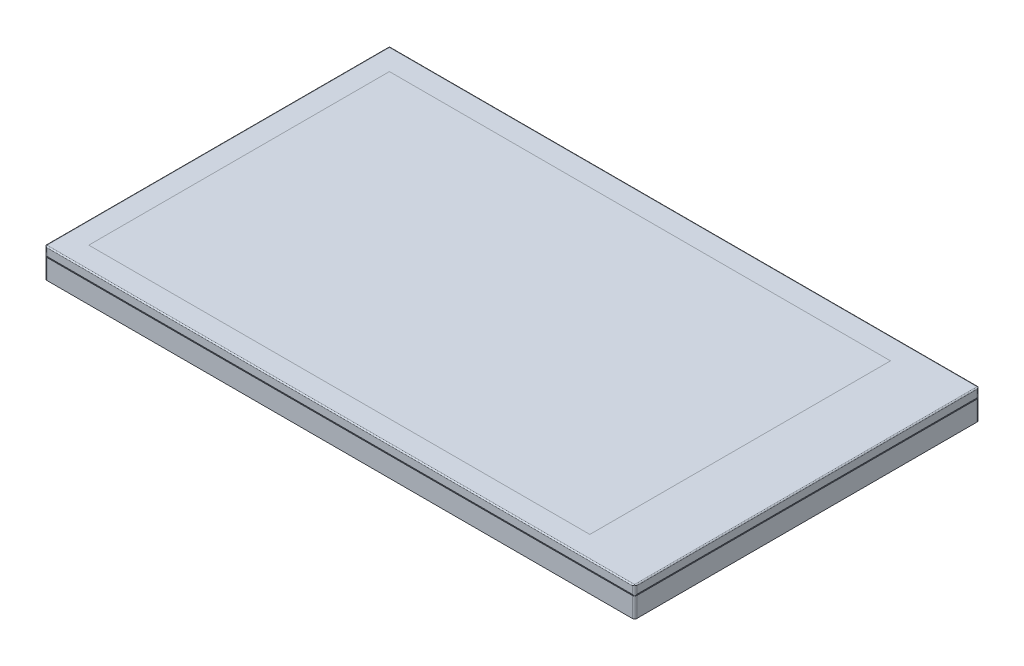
ISO-10303-21;
HEADER;
FILE_DESCRIPTION(('STEP AP214'),'2;1');
FILE_NAME('part.step','',(''),(''),'','','');
FILE_SCHEMA(('AUTOMOTIVE_DESIGN { 1 0 10303 214 1 1 1 1 }'));
ENDSEC;
DATA;
#1=APPLICATION_CONTEXT('core data for automotive mechanical design processes');
#2=APPLICATION_PROTOCOL_DEFINITION('international standard','automotive_design',2000,#1);
#3=PRODUCT_CONTEXT('',#1,'mechanical');
#4=PRODUCT('Part','Part','',(#3));
#5=PRODUCT_RELATED_PRODUCT_CATEGORY('part','',(#4));
#6=PRODUCT_DEFINITION_FORMATION('','',#4);
#7=PRODUCT_DEFINITION_CONTEXT('part definition',#1,'design');
#8=PRODUCT_DEFINITION('design','',#6,#7);
#9=PRODUCT_DEFINITION_SHAPE('','',#8);
#10=(LENGTH_UNIT() NAMED_UNIT(*) SI_UNIT(.MILLI.,.METRE.));
#11=(NAMED_UNIT(*) PLANE_ANGLE_UNIT() SI_UNIT($,.RADIAN.));
#12=(NAMED_UNIT(*) SI_UNIT($,.STERADIAN.) SOLID_ANGLE_UNIT());
#13=UNCERTAINTY_MEASURE_WITH_UNIT(LENGTH_MEASURE(1.E-05),#10,'distance_accuracy_value','');
#14=(GEOMETRIC_REPRESENTATION_CONTEXT(3) GLOBAL_UNCERTAINTY_ASSIGNED_CONTEXT((#13)) GLOBAL_UNIT_ASSIGNED_CONTEXT((#10,
#11,#12)) REPRESENTATION_CONTEXT('',''));
#15=CARTESIAN_POINT('',(0.,0.,0.));
#16=DIRECTION('',(0.,0.,1.));
#17=DIRECTION('',(1.,0.,0.));
#18=AXIS2_PLACEMENT_3D('',#15,#16,#17);
#19=CARTESIAN_POINT('',(0.,3.85,0.));
#20=DIRECTION('',(0.,-1.,0.));
#21=DIRECTION('',(0.,0.,-1.));
#22=AXIS2_PLACEMENT_3D('',#19,#20,#21);
#23=PLANE('',#22);
#24=DIRECTION('',(-1.,0.,0.));
#25=VECTOR('',#24,1.);
#26=CARTESIAN_POINT('',(61.5,3.85,-22.35));
#27=LINE('',#26,#25);
#28=CARTESIAN_POINT('',(38.35,3.85000000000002,-22.35));
#29=VERTEX_POINT('',#28);
#30=CARTESIAN_POINT('',(-38.35,3.85,-22.35));
#31=VERTEX_POINT('',#30);
#32=EDGE_CURVE('E234',#29,#31,#27,.T.);
#33=ORIENTED_EDGE('',*,*,#32,.T.);
#34=DIRECTION('',(0.,0.,1.));
#35=VECTOR('',#34,1.);
#36=CARTESIAN_POINT('',(-38.35,3.84999999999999,-50.));
#37=LINE('',#36,#35);
#38=CARTESIAN_POINT('',(-38.35,3.84999999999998,22.35));
#39=VERTEX_POINT('',#38);
#40=EDGE_CURVE('E300',#31,#39,#37,.T.);
#41=ORIENTED_EDGE('',*,*,#40,.T.);
#42=DIRECTION('',(-1.,0.,0.));
#43=VECTOR('',#42,1.);
#44=CARTESIAN_POINT('',(61.5,3.84999999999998,22.35));
#45=LINE('',#44,#43);
#46=CARTESIAN_POINT('',(38.35,3.85,22.35));
#47=VERTEX_POINT('',#46);
#48=EDGE_CURVE('E416',#47,#39,#45,.T.);
#49=ORIENTED_EDGE('',*,*,#48,.F.);
#50=DIRECTION('',(0.,0.,1.));
#51=VECTOR('',#50,1.);
#52=CARTESIAN_POINT('',(38.35,3.85,-50.));
#53=LINE('',#52,#51);
#54=EDGE_CURVE('E332',#29,#47,#53,.T.);
#55=ORIENTED_EDGE('',*,*,#54,.F.);
#56=EDGE_LOOP('',(#33,#41,#49,#55));
#57=FACE_BOUND('',#56,.T.);
#58=DIRECTION('',(0.,0.,1.));
#59=VECTOR('',#58,1.);
#60=CARTESIAN_POINT('',(-35.62,3.85,0.));
#61=LINE('',#60,#59);
#62=CARTESIAN_POINT('',(-35.62,3.85000000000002,-19.62));
#63=VERTEX_POINT('',#62);
#64=CARTESIAN_POINT('',(-35.62,3.85,19.62));
#65=VERTEX_POINT('',#64);
#66=EDGE_CURVE('E13',#63,#65,#61,.T.);
#67=ORIENTED_EDGE('',*,*,#66,.F.);
#68=DIRECTION('',(-1.,0.,0.));
#69=VECTOR('',#68,1.);
#70=CARTESIAN_POINT('',(0.,3.85,-19.62));
#71=LINE('',#70,#69);
#72=CARTESIAN_POINT('',(29.78,3.85000000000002,-19.62));
#73=VERTEX_POINT('',#72);
#74=EDGE_CURVE('E493',#73,#63,#71,.T.);
#75=ORIENTED_EDGE('',*,*,#74,.F.);
#76=DIRECTION('',(0.,0.,-1.));
#77=VECTOR('',#76,1.);
#78=CARTESIAN_POINT('',(29.78,3.85,0.));
#79=LINE('',#78,#77);
#80=CARTESIAN_POINT('',(29.78,3.85,19.62));
#81=VERTEX_POINT('',#80);
#82=EDGE_CURVE('E494',#81,#73,#79,.T.);
#83=ORIENTED_EDGE('',*,*,#82,.F.);
#84=DIRECTION('',(1.,0.,0.));
#85=VECTOR('',#84,1.);
#86=CARTESIAN_POINT('',(0.,3.85,19.62));
#87=LINE('',#86,#85);
#88=EDGE_CURVE('E63',#65,#81,#87,.T.);
#89=ORIENTED_EDGE('',*,*,#88,.F.);
#90=EDGE_LOOP('',(#67,#75,#83,#89));
#91=FACE_BOUND('',#90,.T.);
#92=ADVANCED_FACE('F53',(#57,#91),#23,.F.);
#93=ORIENTED_EDGE('',*,*,#74,.T.);
#94=ORIENTED_EDGE('',*,*,#66,.T.);
#95=ORIENTED_EDGE('',*,*,#88,.T.);
#96=ORIENTED_EDGE('',*,*,#82,.T.);
#97=EDGE_LOOP('',(#93,#94,#95,#96));
#98=FACE_BOUND('',#97,.T.);
#99=ADVANCED_FACE('F288',(#98),#23,.F.);
#100=CARTESIAN_POINT('',(-38.5,3.85,-22.5));
#101=DIRECTION('',(0.,0.,1.));
#102=DIRECTION('',(1.,0.,0.));
#103=AXIS2_PLACEMENT_3D('',#100,#101,#102);
#104=PLANE('',#103);
#105=DIRECTION('',(0.,-1.,0.));
#106=VECTOR('',#105,1.);
#107=CARTESIAN_POINT('',(-38.2,3.85,-22.5));
#108=LINE('',#107,#106);
#109=CARTESIAN_POINT('',(-38.2,2.75,-22.5));
#110=VERTEX_POINT('',#109);
#111=CARTESIAN_POINT('',(-38.2,3.7,-22.5));
#112=VERTEX_POINT('',#111);
#113=EDGE_CURVE('E243',#110,#112,#108,.F.);
#114=ORIENTED_EDGE('',*,*,#113,.T.);
#115=DIRECTION('',(-1.,0.,0.));
#116=VECTOR('',#115,1.);
#117=CARTESIAN_POINT('',(61.5,3.7,-22.5));
#118=LINE('',#117,#116);
#119=CARTESIAN_POINT('',(38.2,3.70000000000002,-22.5));
#120=VERTEX_POINT('',#119);
#121=EDGE_CURVE('E225',#120,#112,#118,.T.);
#122=ORIENTED_EDGE('',*,*,#121,.F.);
#123=DIRECTION('',(0.,-1.,0.));
#124=VECTOR('',#123,1.);
#125=CARTESIAN_POINT('',(38.2,3.85000000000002,-22.5));
#126=LINE('',#125,#124);
#127=CARTESIAN_POINT('',(38.2,2.75000000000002,-22.5));
#128=VERTEX_POINT('',#127);
#129=EDGE_CURVE('E240',#120,#128,#126,.T.);
#130=ORIENTED_EDGE('',*,*,#129,.T.);
#131=DIRECTION('',(-1.,0.,0.));
#132=VECTOR('',#131,1.);
#133=CARTESIAN_POINT('',(61.5,2.75,-22.5));
#134=LINE('',#133,#132);
#135=EDGE_CURVE('E550',#128,#110,#134,.T.);
#136=ORIENTED_EDGE('',*,*,#135,.T.);
#137=EDGE_LOOP('',(#114,#122,#130,#136));
#138=FACE_BOUND('',#137,.T.);
#139=ADVANCED_FACE('F238',(#138),#104,.F.);
#140=CARTESIAN_POINT('',(-38.2,3.85,-22.2));
#141=DIRECTION('',(0.,-1.,0.));
#142=DIRECTION('',(0.,0.,-1.));
#143=AXIS2_PLACEMENT_3D('',#140,#141,#142);
#144=CYLINDRICAL_SURFACE('',#143,0.3);
#145=CARTESIAN_POINT('',(-38.4598076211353,3.85,-22.35));
#146=CARTESIAN_POINT('',(-38.4533192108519,3.84998671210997,-22.3612714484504));
#147=CARTESIAN_POINT('',(-38.4461253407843,3.84873596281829,-22.3720101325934));
#148=CARTESIAN_POINT('',(-38.4307551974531,3.84433115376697,-22.3921121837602));
#149=CARTESIAN_POINT('',(-38.422593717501,3.84120337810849,-22.4014923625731));
#150=CARTESIAN_POINT('',(-38.4038947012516,3.83286018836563,-22.4205426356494));
#151=CARTESIAN_POINT('',(-38.3932007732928,3.82736050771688,-22.4299272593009));
#152=CARTESIAN_POINT('',(-38.3710569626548,3.81502326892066,-22.4468497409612));
#153=CARTESIAN_POINT('',(-38.3596028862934,3.80817779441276,-22.4543760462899));
#154=CARTESIAN_POINT('',(-38.3314887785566,3.79064939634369,-22.4703100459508));
#155=CARTESIAN_POINT('',(-38.3146005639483,3.77953575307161,-22.4778383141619));
#156=CARTESIAN_POINT('',(-38.2803840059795,3.75640250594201,-22.4895953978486));
#157=CARTESIAN_POINT('',(-38.2630562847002,3.7443841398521,-22.493828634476));
#158=CARTESIAN_POINT('',(-38.2314042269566,3.72220046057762,-22.4986980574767));
#159=CARTESIAN_POINT('',(-38.2171127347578,3.71210018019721,-22.4998520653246));
#160=CARTESIAN_POINT('',(-38.2018855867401,3.70133331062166,-22.4999955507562));
#161=CARTESIAN_POINT('',(-38.2009427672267,3.70066663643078,-22.4999999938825));
#162=CARTESIAN_POINT('',(-38.2,3.7,-22.5));
#163=B_SPLINE_CURVE_WITH_KNOTS('',3,(#145,#146,#147,#148,#149,#150,#151,#152,#153,#154,#155,
#156,#157,#158,#159,#160,#161,#162),.UNSPECIFIED.,.F.,.F.,(4,2,2,2,2,2,2,2,4),(0.,
0.0387726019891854,0.0770145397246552,0.122544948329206,0.168351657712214,0.232726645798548,
0.297015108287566,0.349497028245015,0.352961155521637),.UNSPECIFIED.);
#164=CARTESIAN_POINT('',(-38.4121320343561,3.83652695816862,-22.4121320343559));
#165=VERTEX_POINT('',#164);
#166=EDGE_CURVE('E553',#112,#165,#163,.F.);
#167=ORIENTED_EDGE('',*,*,#166,.F.);
#168=ORIENTED_EDGE('',*,*,#113,.F.);
#169=CARTESIAN_POINT('',(-38.4598076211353,2.6,-22.35));
#170=CARTESIAN_POINT('',(-38.4533192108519,2.60001328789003,-22.3612714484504));
#171=CARTESIAN_POINT('',(-38.4461253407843,2.60126403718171,-22.3720101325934));
#172=CARTESIAN_POINT('',(-38.4307551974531,2.60566884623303,-22.3921121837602));
#173=CARTESIAN_POINT('',(-38.422593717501,2.60879662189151,-22.4014923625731));
#174=CARTESIAN_POINT('',(-38.4038947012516,2.61713981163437,-22.4205426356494));
#175=CARTESIAN_POINT('',(-38.3932007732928,2.62263949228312,-22.4299272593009));
#176=CARTESIAN_POINT('',(-38.3710569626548,2.63497673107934,-22.4468497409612));
#177=CARTESIAN_POINT('',(-38.3596028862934,2.64182220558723,-22.4543760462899));
#178=CARTESIAN_POINT('',(-38.3314887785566,2.65935060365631,-22.4703100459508));
#179=CARTESIAN_POINT('',(-38.3146005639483,2.6704642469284,-22.4778383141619));
#180=CARTESIAN_POINT('',(-38.2803840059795,2.69359749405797,-22.4895953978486));
#181=CARTESIAN_POINT('',(-38.2630562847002,2.70561586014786,-22.493828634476));
#182=CARTESIAN_POINT('',(-38.2314042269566,2.7277995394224,-22.4986980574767));
#183=CARTESIAN_POINT('',(-38.2171127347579,2.7378998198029,-22.4998520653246));
#184=CARTESIAN_POINT('',(-38.2018855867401,2.74866668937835,-22.4999955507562));
#185=CARTESIAN_POINT('',(-38.2009427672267,2.74933336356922,-22.4999999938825));
#186=CARTESIAN_POINT('',(-38.2,2.75,-22.5));
#187=B_SPLINE_CURVE_WITH_KNOTS('',3,(#169,#170,#171,#172,#173,#174,#175,#176,#177,#178,#179,
#180,#181,#182,#183,#184,#185,#186),.UNSPECIFIED.,.F.,.F.,(4,2,2,2,2,2,2,2,4),(0.,
0.0387726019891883,0.0770145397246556,0.122544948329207,0.168351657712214,0.232726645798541,
0.297015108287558,0.349497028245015,0.352961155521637),.UNSPECIFIED.);
#188=CARTESIAN_POINT('',(-38.4121320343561,2.61347304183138,-22.4121320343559));
#189=VERTEX_POINT('',#188);
#190=EDGE_CURVE('E426',#189,#110,#187,.T.);
#191=ORIENTED_EDGE('',*,*,#190,.F.);
#192=CARTESIAN_POINT('',(-38.35,2.6,-22.4598076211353));
#193=CARTESIAN_POINT('',(-38.3612714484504,2.60001328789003,-22.4533192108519));
#194=CARTESIAN_POINT('',(-38.3720101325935,2.60126403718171,-22.4461253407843));
#195=CARTESIAN_POINT('',(-38.3921121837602,2.60566884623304,-22.4307551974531));
#196=CARTESIAN_POINT('',(-38.4014923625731,2.60879662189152,-22.422593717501));
#197=CARTESIAN_POINT('',(-38.4205426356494,2.61713981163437,-22.4038947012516));
#198=CARTESIAN_POINT('',(-38.4299272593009,2.62263949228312,-22.3932007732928));
#199=CARTESIAN_POINT('',(-38.4468497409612,2.63497673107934,-22.3710569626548));
#200=CARTESIAN_POINT('',(-38.4543760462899,2.64182220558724,-22.3596028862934));
#201=CARTESIAN_POINT('',(-38.4703100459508,2.65935060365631,-22.3314887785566));
#202=CARTESIAN_POINT('',(-38.4778383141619,2.6704642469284,-22.3146005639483));
#203=CARTESIAN_POINT('',(-38.4895953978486,2.69359749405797,-22.2803840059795));
#204=CARTESIAN_POINT('',(-38.493828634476,2.70561586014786,-22.2630562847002));
#205=CARTESIAN_POINT('',(-38.4986980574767,2.7277995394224,-22.2314042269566));
#206=CARTESIAN_POINT('',(-38.4998520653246,2.73789981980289,-22.2171127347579));
#207=CARTESIAN_POINT('',(-38.4999955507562,2.74866668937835,-22.2018855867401));
#208=CARTESIAN_POINT('',(-38.4999999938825,2.74933336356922,-22.2009427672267));
#209=CARTESIAN_POINT('',(-38.5,2.75,-22.2));
#210=B_SPLINE_CURVE_WITH_KNOTS('',3,(#192,#193,#194,#195,#196,#197,#198,#199,#200,#201,#202,
#203,#204,#205,#206,#207,#208,#209),.UNSPECIFIED.,.F.,.F.,(4,2,2,2,2,2,2,2,4),(0.,
0.0387726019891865,0.0770145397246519,0.122544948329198,0.168351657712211,0.232726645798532,
0.297015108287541,0.349497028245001,0.352961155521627),.UNSPECIFIED.);
#211=CARTESIAN_POINT('',(-38.5,2.75,-22.2));
#212=VERTEX_POINT('',#211);
#213=EDGE_CURVE('E272',#212,#189,#210,.F.);
#214=ORIENTED_EDGE('',*,*,#213,.F.);
#215=DIRECTION('',(0.,-1.,0.));
#216=VECTOR('',#215,1.);
#217=CARTESIAN_POINT('',(-38.5,3.85,-22.2));
#218=LINE('',#217,#216);
#219=CARTESIAN_POINT('',(-38.5,3.7,-22.2));
#220=VERTEX_POINT('',#219);
#221=EDGE_CURVE('E595',#220,#212,#218,.T.);
#222=ORIENTED_EDGE('',*,*,#221,.F.);
#223=CARTESIAN_POINT('',(-38.35,3.84999999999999,-22.4598076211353));
#224=CARTESIAN_POINT('',(-38.3612714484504,3.84998671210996,-22.4533192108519));
#225=CARTESIAN_POINT('',(-38.3720101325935,3.84873596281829,-22.4461253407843));
#226=CARTESIAN_POINT('',(-38.3921121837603,3.84433115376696,-22.4307551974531));
#227=CARTESIAN_POINT('',(-38.4014923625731,3.84120337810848,-22.422593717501));
#228=CARTESIAN_POINT('',(-38.4205426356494,3.83286018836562,-22.4038947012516));
#229=CARTESIAN_POINT('',(-38.4299272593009,3.82736050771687,-22.3932007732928));
#230=CARTESIAN_POINT('',(-38.4468497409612,3.81502326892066,-22.3710569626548));
#231=CARTESIAN_POINT('',(-38.4543760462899,3.80817779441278,-22.3596028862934));
#232=CARTESIAN_POINT('',(-38.4703100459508,3.79064939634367,-22.3314887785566));
#233=CARTESIAN_POINT('',(-38.4778383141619,3.77953575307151,-22.3146005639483));
#234=CARTESIAN_POINT('',(-38.4895953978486,3.75640250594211,-22.2803840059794));
#235=CARTESIAN_POINT('',(-38.493828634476,3.74438413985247,-22.2630562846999));
#236=CARTESIAN_POINT('',(-38.4986980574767,3.72220046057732,-22.2314042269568));
#237=CARTESIAN_POINT('',(-38.4998520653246,3.71210018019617,-22.2171127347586));
#238=CARTESIAN_POINT('',(-38.4999955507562,3.70133331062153,-22.2018855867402));
#239=CARTESIAN_POINT('',(-38.4999999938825,3.70066663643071,-22.2009427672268));
#240=CARTESIAN_POINT('',(-38.5,3.7,-22.2));
#241=B_SPLINE_CURVE_WITH_KNOTS('',3,(#223,#224,#225,#226,#227,#228,#229,#230,#231,#232,#233,
#234,#235,#236,#237,#238,#239,#240),.UNSPECIFIED.,.F.,.F.,(4,2,2,2,2,2,2,2,4),(0.,
0.0387726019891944,0.077014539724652,0.122544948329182,0.168351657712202,0.232726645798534,
0.297015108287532,0.349497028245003,0.352961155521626),.UNSPECIFIED.);
#242=EDGE_CURVE('E265',#165,#220,#241,.T.);
#243=ORIENTED_EDGE('',*,*,#242,.F.);
#244=EDGE_LOOP('',(#167,#168,#191,#214,#222,#243));
#245=FACE_BOUND('',#244,.T.);
#246=ADVANCED_FACE('F490',(#245),#144,.T.);
#247=CARTESIAN_POINT('',(38.2,3.85000000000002,-22.2));
#248=DIRECTION('',(0.,-1.,0.));
#249=DIRECTION('',(0.,0.,-1.));
#250=AXIS2_PLACEMENT_3D('',#247,#248,#249);
#251=CYLINDRICAL_SURFACE('',#250,0.3);
#252=CARTESIAN_POINT('',(38.4598076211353,3.85000000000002,-22.35));
#253=CARTESIAN_POINT('',(38.4533192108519,3.84998671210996,-22.3612714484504));
#254=CARTESIAN_POINT('',(38.4461253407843,3.84873596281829,-22.3720101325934));
#255=CARTESIAN_POINT('',(38.4307551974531,3.84433115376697,-22.3921121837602));
#256=CARTESIAN_POINT('',(38.4225937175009,3.8412033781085,-22.4014923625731));
#257=CARTESIAN_POINT('',(38.4038947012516,3.83286018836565,-22.4205426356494));
#258=CARTESIAN_POINT('',(38.3932007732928,3.82736050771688,-22.4299272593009));
#259=CARTESIAN_POINT('',(38.3710569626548,3.81502326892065,-22.4468497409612));
#260=CARTESIAN_POINT('',(38.3596028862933,3.80817779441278,-22.4543760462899));
#261=CARTESIAN_POINT('',(38.3314887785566,3.79064939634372,-22.4703100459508));
#262=CARTESIAN_POINT('',(38.3146005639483,3.77953575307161,-22.4778383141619));
#263=CARTESIAN_POINT('',(38.2803840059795,3.75640250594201,-22.4895953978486));
#264=CARTESIAN_POINT('',(38.2630562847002,3.74438413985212,-22.493828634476));
#265=CARTESIAN_POINT('',(38.2314042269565,3.72220046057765,-22.4986980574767));
#266=CARTESIAN_POINT('',(38.2171127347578,3.71210018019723,-22.4998520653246));
#267=CARTESIAN_POINT('',(38.2018855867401,3.70133331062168,-22.4999955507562));
#268=CARTESIAN_POINT('',(38.2009427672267,3.7006666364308,-22.4999999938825));
#269=CARTESIAN_POINT('',(38.2,3.70000000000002,-22.5));
#270=B_SPLINE_CURVE_WITH_KNOTS('',3,(#252,#253,#254,#255,#256,#257,#258,#259,#260,#261,#262,
#263,#264,#265,#266,#267,#268,#269),.UNSPECIFIED.,.F.,.F.,(4,2,2,2,2,2,2,2,4),(0.,
0.0387726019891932,0.0770145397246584,0.12254494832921,0.16835165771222,0.232726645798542,
0.297015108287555,0.349497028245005,0.352961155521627),.UNSPECIFIED.);
#271=CARTESIAN_POINT('',(38.412132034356,3.83652695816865,-22.4121320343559));
#272=VERTEX_POINT('',#271);
#273=EDGE_CURVE('E222',#272,#120,#270,.T.);
#274=ORIENTED_EDGE('',*,*,#273,.F.);
#275=CARTESIAN_POINT('',(38.35,3.85000000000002,-22.4598076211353));
#276=CARTESIAN_POINT('',(38.3612714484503,3.84998671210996,-22.4533192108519));
#277=CARTESIAN_POINT('',(38.3720101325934,3.84873596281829,-22.4461253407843));
#278=CARTESIAN_POINT('',(38.3921121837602,3.84433115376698,-22.4307551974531));
#279=CARTESIAN_POINT('',(38.401492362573,3.84120337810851,-22.422593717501));
#280=CARTESIAN_POINT('',(38.4205426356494,3.83286018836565,-22.4038947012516));
#281=CARTESIAN_POINT('',(38.4299272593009,3.82736050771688,-22.3932007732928));
#282=CARTESIAN_POINT('',(38.4468497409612,3.81502326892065,-22.3710569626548));
#283=CARTESIAN_POINT('',(38.4543760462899,3.80817779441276,-22.3596028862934));
#284=CARTESIAN_POINT('',(38.4703100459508,3.79064939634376,-22.3314887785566));
#285=CARTESIAN_POINT('',(38.4778383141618,3.77953575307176,-22.3146005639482));
#286=CARTESIAN_POINT('',(38.4895953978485,3.7564025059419,-22.2803840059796));
#287=CARTESIAN_POINT('',(38.493828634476,3.74438413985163,-22.2630562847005));
#288=CARTESIAN_POINT('',(38.4986980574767,3.72220046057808,-22.2314042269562));
#289=CARTESIAN_POINT('',(38.4998520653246,3.71210018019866,-22.2171127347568));
#290=CARTESIAN_POINT('',(38.4999955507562,3.70133331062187,-22.20188558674));
#291=CARTESIAN_POINT('',(38.4999999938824,3.7006666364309,-22.2009427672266));
#292=CARTESIAN_POINT('',(38.5,3.70000000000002,-22.2));
#293=B_SPLINE_CURVE_WITH_KNOTS('',3,(#275,#276,#277,#278,#279,#280,#281,#282,#283,#284,#285,
#286,#287,#288,#289,#290,#291,#292),.UNSPECIFIED.,.F.,.F.,(4,2,2,2,2,2,2,2,4),(0.,
0.0387726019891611,0.0770145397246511,0.122544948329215,0.168351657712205,0.232726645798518,
0.297015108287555,0.349497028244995,0.352961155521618),.UNSPECIFIED.);
#294=CARTESIAN_POINT('',(38.5,3.70000000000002,-22.2));
#295=VERTEX_POINT('',#294);
#296=EDGE_CURVE('E459',#295,#272,#293,.F.);
#297=ORIENTED_EDGE('',*,*,#296,.F.);
#298=DIRECTION('',(0.,-1.,0.));
#299=VECTOR('',#298,1.);
#300=CARTESIAN_POINT('',(38.5,3.85000000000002,-22.2));
#301=LINE('',#300,#299);
#302=CARTESIAN_POINT('',(38.5,2.75000000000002,-22.2));
#303=VERTEX_POINT('',#302);
#304=EDGE_CURVE('E258',#303,#295,#301,.F.);
#305=ORIENTED_EDGE('',*,*,#304,.F.);
#306=CARTESIAN_POINT('',(38.35,2.60000000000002,-22.4598076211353));
#307=CARTESIAN_POINT('',(38.3612714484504,2.60001328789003,-22.4533192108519));
#308=CARTESIAN_POINT('',(38.3720101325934,2.6012640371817,-22.4461253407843));
#309=CARTESIAN_POINT('',(38.3921121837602,2.60566884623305,-22.4307551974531));
#310=CARTESIAN_POINT('',(38.4014923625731,2.60879662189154,-22.4225937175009));
#311=CARTESIAN_POINT('',(38.4205426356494,2.6171398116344,-22.4038947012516));
#312=CARTESIAN_POINT('',(38.4299272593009,2.62263949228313,-22.3932007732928));
#313=CARTESIAN_POINT('',(38.4468497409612,2.63497673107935,-22.3710569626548));
#314=CARTESIAN_POINT('',(38.4543760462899,2.64182220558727,-22.3596028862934));
#315=CARTESIAN_POINT('',(38.4703100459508,2.65935060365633,-22.3314887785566));
#316=CARTESIAN_POINT('',(38.4778383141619,2.67046424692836,-22.3146005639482));
#317=CARTESIAN_POINT('',(38.4895953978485,2.69359749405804,-22.2803840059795));
#318=CARTESIAN_POINT('',(38.493828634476,2.70561586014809,-22.2630562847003));
#319=CARTESIAN_POINT('',(38.4986980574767,2.72779953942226,-22.2314042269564));
#320=CARTESIAN_POINT('',(38.4998520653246,2.73789981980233,-22.2171127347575));
#321=CARTESIAN_POINT('',(38.4999955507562,2.7486666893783,-22.2018855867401));
#322=CARTESIAN_POINT('',(38.4999999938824,2.7493333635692,-22.2009427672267));
#323=CARTESIAN_POINT('',(38.5,2.75000000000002,-22.2));
#324=B_SPLINE_CURVE_WITH_KNOTS('',3,(#306,#307,#308,#309,#310,#311,#312,#313,#314,#315,#316,
#317,#318,#319,#320,#321,#322,#323),.UNSPECIFIED.,.F.,.F.,(4,2,2,2,2,2,2,2,4),(0.,
0.0387726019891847,0.0770145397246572,0.122544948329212,0.168351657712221,0.232726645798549,
0.297015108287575,0.349497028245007,0.352961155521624),.UNSPECIFIED.);
#325=CARTESIAN_POINT('',(38.412132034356,2.6134730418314,-22.4121320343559));
#326=VERTEX_POINT('',#325);
#327=EDGE_CURVE('E453',#326,#303,#324,.T.);
#328=ORIENTED_EDGE('',*,*,#327,.F.);
#329=CARTESIAN_POINT('',(38.4598076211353,2.60000000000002,-22.35));
#330=CARTESIAN_POINT('',(38.4533192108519,2.60001328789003,-22.3612714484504));
#331=CARTESIAN_POINT('',(38.4461253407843,2.6012640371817,-22.3720101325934));
#332=CARTESIAN_POINT('',(38.4307551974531,2.60566884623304,-22.3921121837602));
#333=CARTESIAN_POINT('',(38.4225937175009,2.60879662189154,-22.4014923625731));
#334=CARTESIAN_POINT('',(38.4038947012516,2.6171398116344,-22.4205426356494));
#335=CARTESIAN_POINT('',(38.3932007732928,2.62263949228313,-22.4299272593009));
#336=CARTESIAN_POINT('',(38.3710569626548,2.63497673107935,-22.4468497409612));
#337=CARTESIAN_POINT('',(38.3596028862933,2.64182220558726,-22.4543760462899));
#338=CARTESIAN_POINT('',(38.3314887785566,2.65935060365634,-22.4703100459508));
#339=CARTESIAN_POINT('',(38.3146005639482,2.67046424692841,-22.4778383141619));
#340=CARTESIAN_POINT('',(38.2803840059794,2.69359749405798,-22.4895953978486));
#341=CARTESIAN_POINT('',(38.2630562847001,2.70561586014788,-22.493828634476));
#342=CARTESIAN_POINT('',(38.2314042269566,2.72779953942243,-22.4986980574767));
#343=CARTESIAN_POINT('',(38.2171127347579,2.73789981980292,-22.4998520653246));
#344=CARTESIAN_POINT('',(38.2018855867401,2.74866668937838,-22.4999955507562));
#345=CARTESIAN_POINT('',(38.2009427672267,2.74933336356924,-22.4999999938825));
#346=CARTESIAN_POINT('',(38.2,2.75000000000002,-22.5));
#347=B_SPLINE_CURVE_WITH_KNOTS('',3,(#329,#330,#331,#332,#333,#334,#335,#336,#337,#338,#339,
#340,#341,#342,#343,#344,#345,#346),.UNSPECIFIED.,.F.,.F.,(4,2,2,2,2,2,2,2,4),(0.,
0.0387726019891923,0.0770145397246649,0.12254494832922,0.16835165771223,0.232726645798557,
0.297015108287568,0.349497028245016,0.352961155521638),.UNSPECIFIED.);
#348=EDGE_CURVE('E248',#128,#326,#347,.F.);
#349=ORIENTED_EDGE('',*,*,#348,.F.);
#350=ORIENTED_EDGE('',*,*,#129,.F.);
#351=EDGE_LOOP('',(#274,#297,#305,#328,#349,#350));
#352=FACE_BOUND('',#351,.T.);
#353=ADVANCED_FACE('F246',(#352),#251,.T.);
#354=CARTESIAN_POINT('',(-38.5,3.84999999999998,22.5));
#355=DIRECTION('',(0.,0.,-1.));
#356=DIRECTION('',(-1.,0.,0.));
#357=AXIS2_PLACEMENT_3D('',#354,#355,#356);
#358=PLANE('',#357);
#359=DIRECTION('',(-1.,0.,0.));
#360=VECTOR('',#359,1.);
#361=CARTESIAN_POINT('',(61.5,3.69999999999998,22.5));
#362=LINE('',#361,#360);
#363=CARTESIAN_POINT('',(38.2,3.7,22.5));
#364=VERTEX_POINT('',#363);
#365=CARTESIAN_POINT('',(-38.2,3.69999999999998,22.5));
#366=VERTEX_POINT('',#365);
#367=EDGE_CURVE('E425',#364,#366,#362,.T.);
#368=ORIENTED_EDGE('',*,*,#367,.T.);
#369=DIRECTION('',(0.,-1.,0.));
#370=VECTOR('',#369,1.);
#371=CARTESIAN_POINT('',(-38.2,3.84999999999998,22.5));
#372=LINE('',#371,#370);
#373=CARTESIAN_POINT('',(-38.2,2.74999999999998,22.5));
#374=VERTEX_POINT('',#373);
#375=EDGE_CURVE('E578',#366,#374,#372,.T.);
#376=ORIENTED_EDGE('',*,*,#375,.T.);
#377=DIRECTION('',(-1.,0.,0.));
#378=VECTOR('',#377,1.);
#379=CARTESIAN_POINT('',(61.5,2.74999999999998,22.5));
#380=LINE('',#379,#378);
#381=CARTESIAN_POINT('',(38.2,2.75,22.5));
#382=VERTEX_POINT('',#381);
#383=EDGE_CURVE('E440',#382,#374,#380,.T.);
#384=ORIENTED_EDGE('',*,*,#383,.F.);
#385=DIRECTION('',(0.,-1.,0.));
#386=VECTOR('',#385,1.);
#387=CARTESIAN_POINT('',(38.2,3.85,22.5));
#388=LINE('',#387,#386);
#389=EDGE_CURVE('E579',#382,#364,#388,.F.);
#390=ORIENTED_EDGE('',*,*,#389,.T.);
#391=EDGE_LOOP('',(#368,#376,#384,#390));
#392=FACE_BOUND('',#391,.T.);
#393=ADVANCED_FACE('F576',(#392),#358,.F.);
#394=CARTESIAN_POINT('',(-38.2,3.84999999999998,22.2));
#395=DIRECTION('',(0.,-1.,0.));
#396=DIRECTION('',(0.,0.,-1.));
#397=AXIS2_PLACEMENT_3D('',#394,#395,#396);
#398=CYLINDRICAL_SURFACE('',#397,0.3);
#399=CARTESIAN_POINT('',(-38.4598076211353,3.84999999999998,22.35));
#400=CARTESIAN_POINT('',(-38.4533192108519,3.84998671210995,22.3612714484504));
#401=CARTESIAN_POINT('',(-38.4461253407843,3.84873596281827,22.3720101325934));
#402=CARTESIAN_POINT('',(-38.4307551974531,3.84433115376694,22.3921121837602));
#403=CARTESIAN_POINT('',(-38.422593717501,3.84120337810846,22.4014923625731));
#404=CARTESIAN_POINT('',(-38.4038947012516,3.83286018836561,22.4205426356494));
#405=CARTESIAN_POINT('',(-38.3932007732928,3.82736050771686,22.4299272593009));
#406=CARTESIAN_POINT('',(-38.3710569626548,3.81502326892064,22.4468497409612));
#407=CARTESIAN_POINT('',(-38.3596028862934,3.80817779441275,22.4543760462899));
#408=CARTESIAN_POINT('',(-38.3314887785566,3.79064939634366,22.4703100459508));
#409=CARTESIAN_POINT('',(-38.3146005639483,3.77953575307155,22.4778383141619));
#410=CARTESIAN_POINT('',(-38.2803840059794,3.75640250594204,22.4895953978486));
#411=CARTESIAN_POINT('',(-38.2630562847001,3.74438413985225,22.493828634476));
#412=CARTESIAN_POINT('',(-38.2314042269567,3.72220046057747,22.4986980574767));
#413=CARTESIAN_POINT('',(-38.2171127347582,3.71210018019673,22.4998520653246));
#414=CARTESIAN_POINT('',(-38.2018855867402,3.70133331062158,22.4999955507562));
#415=CARTESIAN_POINT('',(-38.2009427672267,3.70066663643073,22.4999999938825));
#416=CARTESIAN_POINT('',(-38.2,3.69999999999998,22.5));
#417=B_SPLINE_CURVE_WITH_KNOTS('',3,(#399,#400,#401,#402,#403,#404,#405,#406,#407,#408,#409,
#410,#411,#412,#413,#414,#415,#416),.UNSPECIFIED.,.F.,.F.,(4,2,2,2,2,2,2,2,4),(0.,
0.0387726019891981,0.0770145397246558,0.122544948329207,0.168351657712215,0.232726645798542,
0.297015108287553,0.349497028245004,0.352961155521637),.UNSPECIFIED.);
#418=CARTESIAN_POINT('',(-38.4121320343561,3.8365269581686,22.4121320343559));
#419=VERTEX_POINT('',#418);
#420=EDGE_CURVE('E429',#419,#366,#417,.T.);
#421=ORIENTED_EDGE('',*,*,#420,.F.);
#422=CARTESIAN_POINT('',(-38.35,3.84999999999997,22.4598076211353));
#423=CARTESIAN_POINT('',(-38.3612714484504,3.84998671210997,22.4533192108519));
#424=CARTESIAN_POINT('',(-38.3720101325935,3.84873596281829,22.4461253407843));
#425=CARTESIAN_POINT('',(-38.3921121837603,3.84433115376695,22.4307551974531));
#426=CARTESIAN_POINT('',(-38.4014923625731,3.84120337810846,22.4225937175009));
#427=CARTESIAN_POINT('',(-38.4205426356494,3.8328601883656,22.4038947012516));
#428=CARTESIAN_POINT('',(-38.4299272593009,3.82736050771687,22.3932007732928));
#429=CARTESIAN_POINT('',(-38.4468497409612,3.81502326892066,22.3710569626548));
#430=CARTESIAN_POINT('',(-38.4543760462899,3.80817779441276,22.3596028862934));
#431=CARTESIAN_POINT('',(-38.4703100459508,3.79064939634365,22.3314887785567));
#432=CARTESIAN_POINT('',(-38.4778383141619,3.7795357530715,22.3146005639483));
#433=CARTESIAN_POINT('',(-38.4895953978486,3.7564025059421,22.2803840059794));
#434=CARTESIAN_POINT('',(-38.493828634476,3.74438413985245,22.2630562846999));
#435=CARTESIAN_POINT('',(-38.4986980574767,3.7222004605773,22.2314042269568));
#436=CARTESIAN_POINT('',(-38.4998520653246,3.71210018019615,22.2171127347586));
#437=CARTESIAN_POINT('',(-38.4999955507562,3.7013333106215,22.2018855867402));
#438=CARTESIAN_POINT('',(-38.4999999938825,3.70066663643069,22.2009427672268));
#439=CARTESIAN_POINT('',(-38.5,3.69999999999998,22.2));
#440=B_SPLINE_CURVE_WITH_KNOTS('',3,(#422,#423,#424,#425,#426,#427,#428,#429,#430,#431,#432,
#433,#434,#435,#436,#437,#438,#439),.UNSPECIFIED.,.F.,.F.,(4,2,2,2,2,2,2,2,4),(0.,
0.0387726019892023,0.0770145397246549,0.122544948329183,0.168351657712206,0.232726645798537,
0.297015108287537,0.349497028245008,0.352961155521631),.UNSPECIFIED.);
#441=CARTESIAN_POINT('',(-38.5,3.69999999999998,22.2));
#442=VERTEX_POINT('',#441);
#443=EDGE_CURVE('E292',#442,#419,#440,.F.);
#444=ORIENTED_EDGE('',*,*,#443,.F.);
#445=DIRECTION('',(0.,-1.,0.));
#446=VECTOR('',#445,1.);
#447=CARTESIAN_POINT('',(-38.5,3.84999999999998,22.2));
#448=LINE('',#447,#446);
#449=CARTESIAN_POINT('',(-38.5,2.74999999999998,22.2));
#450=VERTEX_POINT('',#449);
#451=EDGE_CURVE('E597',#450,#442,#448,.F.);
#452=ORIENTED_EDGE('',*,*,#451,.F.);
#453=CARTESIAN_POINT('',(-38.35,2.59999999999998,22.4598076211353));
#454=CARTESIAN_POINT('',(-38.3612714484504,2.60001328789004,22.4533192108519));
#455=CARTESIAN_POINT('',(-38.3720101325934,2.60126403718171,22.4461253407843));
#456=CARTESIAN_POINT('',(-38.3921121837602,2.60566884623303,22.4307551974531));
#457=CARTESIAN_POINT('',(-38.4014923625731,2.6087966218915,22.422593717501));
#458=CARTESIAN_POINT('',(-38.4205426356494,2.61713981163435,22.4038947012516));
#459=CARTESIAN_POINT('',(-38.4299272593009,2.62263949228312,22.3932007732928));
#460=CARTESIAN_POINT('',(-38.4468497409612,2.63497673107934,22.3710569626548));
#461=CARTESIAN_POINT('',(-38.4543760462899,2.64182220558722,22.3596028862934));
#462=CARTESIAN_POINT('',(-38.4703100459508,2.65935060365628,22.3314887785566));
#463=CARTESIAN_POINT('',(-38.4778383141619,2.67046424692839,22.3146005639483));
#464=CARTESIAN_POINT('',(-38.4895953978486,2.69359749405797,22.2803840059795));
#465=CARTESIAN_POINT('',(-38.493828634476,2.70561586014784,22.2630562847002));
#466=CARTESIAN_POINT('',(-38.4986980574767,2.72779953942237,22.2314042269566));
#467=CARTESIAN_POINT('',(-38.4998520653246,2.73789981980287,22.2171127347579));
#468=CARTESIAN_POINT('',(-38.4999955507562,2.74866668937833,22.2018855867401));
#469=CARTESIAN_POINT('',(-38.4999999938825,2.7493333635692,22.2009427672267));
#470=CARTESIAN_POINT('',(-38.5,2.74999999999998,22.2));
#471=B_SPLINE_CURVE_WITH_KNOTS('',3,(#453,#454,#455,#456,#457,#458,#459,#460,#461,#462,#463,
#464,#465,#466,#467,#468,#469,#470),.UNSPECIFIED.,.F.,.F.,(4,2,2,2,2,2,2,2,4),(0.,
0.0387726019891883,0.0770145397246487,0.122544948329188,0.168351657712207,0.232726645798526,
0.297015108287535,0.349497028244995,0.352961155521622),.UNSPECIFIED.);
#472=CARTESIAN_POINT('',(-38.4121320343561,2.61347304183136,22.4121320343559));
#473=VERTEX_POINT('',#472);
#474=EDGE_CURVE('E318',#473,#450,#471,.T.);
#475=ORIENTED_EDGE('',*,*,#474,.F.);
#476=CARTESIAN_POINT('',(-38.4598076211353,2.59999999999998,22.35));
#477=CARTESIAN_POINT('',(-38.4533192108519,2.60001328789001,22.3612714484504));
#478=CARTESIAN_POINT('',(-38.4461253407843,2.60126403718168,22.3720101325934));
#479=CARTESIAN_POINT('',(-38.4307551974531,2.60566884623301,22.3921121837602));
#480=CARTESIAN_POINT('',(-38.422593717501,2.60879662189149,22.4014923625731));
#481=CARTESIAN_POINT('',(-38.4038947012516,2.61713981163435,22.4205426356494));
#482=CARTESIAN_POINT('',(-38.3932007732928,2.6226394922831,22.4299272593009));
#483=CARTESIAN_POINT('',(-38.3710569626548,2.63497673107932,22.4468497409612));
#484=CARTESIAN_POINT('',(-38.3596028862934,2.64182220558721,22.4543760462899));
#485=CARTESIAN_POINT('',(-38.3314887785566,2.6593506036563,22.4703100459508));
#486=CARTESIAN_POINT('',(-38.3146005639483,2.67046424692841,22.4778383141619));
#487=CARTESIAN_POINT('',(-38.2803840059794,2.69359749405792,22.4895953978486));
#488=CARTESIAN_POINT('',(-38.2630562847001,2.70561586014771,22.493828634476));
#489=CARTESIAN_POINT('',(-38.2314042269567,2.72779953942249,22.4986980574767));
#490=CARTESIAN_POINT('',(-38.2171127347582,2.73789981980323,22.4998520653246));
#491=CARTESIAN_POINT('',(-38.2018855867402,2.74866668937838,22.4999955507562));
#492=CARTESIAN_POINT('',(-38.2009427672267,2.74933336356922,22.4999999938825));
#493=CARTESIAN_POINT('',(-38.2,2.74999999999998,22.5));
#494=B_SPLINE_CURVE_WITH_KNOTS('',3,(#476,#477,#478,#479,#480,#481,#482,#483,#484,#485,#486,
#487,#488,#489,#490,#491,#492,#493),.UNSPECIFIED.,.F.,.F.,(4,2,2,2,2,2,2,2,4),(0.,
0.0387726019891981,0.0770145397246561,0.122544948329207,0.168351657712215,0.232726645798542,
0.297015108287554,0.349497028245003,0.352961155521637),.UNSPECIFIED.);
#495=EDGE_CURVE('E325',#374,#473,#494,.F.);
#496=ORIENTED_EDGE('',*,*,#495,.F.);
#497=ORIENTED_EDGE('',*,*,#375,.F.);
#498=EDGE_LOOP('',(#421,#444,#452,#475,#496,#497));
#499=FACE_BOUND('',#498,.T.);
#500=ADVANCED_FACE('F310',(#499),#398,.T.);
#501=CARTESIAN_POINT('',(38.2,3.85,22.2));
#502=DIRECTION('',(0.,-1.,0.));
#503=DIRECTION('',(0.,0.,-1.));
#504=AXIS2_PLACEMENT_3D('',#501,#502,#503);
#505=CYLINDRICAL_SURFACE('',#504,0.3);
#506=CARTESIAN_POINT('',(38.4598076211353,3.85,22.35));
#507=CARTESIAN_POINT('',(38.4533192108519,3.84998671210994,22.3612714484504));
#508=CARTESIAN_POINT('',(38.4461253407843,3.84873596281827,22.3720101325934));
#509=CARTESIAN_POINT('',(38.4307551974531,3.84433115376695,22.3921121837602));
#510=CARTESIAN_POINT('',(38.4225937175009,3.84120337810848,22.4014923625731));
#511=CARTESIAN_POINT('',(38.4038947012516,3.83286018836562,22.4205426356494));
#512=CARTESIAN_POINT('',(38.3932007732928,3.82736050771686,22.4299272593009));
#513=CARTESIAN_POINT('',(38.3710569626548,3.81502326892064,22.4468497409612));
#514=CARTESIAN_POINT('',(38.3596028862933,3.80817779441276,22.4543760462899));
#515=CARTESIAN_POINT('',(38.3314887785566,3.79064939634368,22.4703100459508));
#516=CARTESIAN_POINT('',(38.3146005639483,3.77953575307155,22.4778383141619));
#517=CARTESIAN_POINT('',(38.2803840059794,3.75640250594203,22.4895953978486));
#518=CARTESIAN_POINT('',(38.2630562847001,3.74438413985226,22.493828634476));
#519=CARTESIAN_POINT('',(38.2314042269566,3.72220046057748,22.4986980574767));
#520=CARTESIAN_POINT('',(38.2171127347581,3.71210018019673,22.4998520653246));
#521=CARTESIAN_POINT('',(38.2018855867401,3.7013333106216,22.4999955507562));
#522=CARTESIAN_POINT('',(38.2009427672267,3.70066663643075,22.4999999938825));
#523=CARTESIAN_POINT('',(38.2,3.7,22.5));
#524=B_SPLINE_CURVE_WITH_KNOTS('',3,(#506,#507,#508,#509,#510,#511,#512,#513,#514,#515,#516,
#517,#518,#519,#520,#521,#522,#523),.UNSPECIFIED.,.F.,.F.,(4,2,2,2,2,2,2,2,4),(0.,
0.0387726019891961,0.077014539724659,0.122544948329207,0.16835165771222,0.232726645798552,
0.29701510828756,0.349497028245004,0.352961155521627),.UNSPECIFIED.);
#525=CARTESIAN_POINT('',(38.4121320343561,3.83652695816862,22.4121320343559));
#526=VERTEX_POINT('',#525);
#527=EDGE_CURVE('E430',#364,#526,#524,.F.);
#528=ORIENTED_EDGE('',*,*,#527,.F.);
#529=ORIENTED_EDGE('',*,*,#389,.F.);
#530=CARTESIAN_POINT('',(38.4598076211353,2.6,22.35));
#531=CARTESIAN_POINT('',(38.4533192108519,2.60001328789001,22.3612714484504));
#532=CARTESIAN_POINT('',(38.4461253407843,2.60126403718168,22.3720101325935));
#533=CARTESIAN_POINT('',(38.4307551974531,2.60566884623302,22.3921121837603));
#534=CARTESIAN_POINT('',(38.4225937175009,2.60879662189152,22.4014923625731));
#535=CARTESIAN_POINT('',(38.4038947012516,2.61713981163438,22.4205426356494));
#536=CARTESIAN_POINT('',(38.3932007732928,2.62263949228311,22.4299272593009));
#537=CARTESIAN_POINT('',(38.3710569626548,2.63497673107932,22.4468497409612));
#538=CARTESIAN_POINT('',(38.3596028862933,2.64182220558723,22.4543760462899));
#539=CARTESIAN_POINT('',(38.3314887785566,2.65935060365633,22.4703100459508));
#540=CARTESIAN_POINT('',(38.3146005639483,2.67046424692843,22.4778383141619));
#541=CARTESIAN_POINT('',(38.2803840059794,2.69359749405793,22.4895953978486));
#542=CARTESIAN_POINT('',(38.2630562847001,2.70561586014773,22.493828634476));
#543=CARTESIAN_POINT('',(38.2314042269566,2.72779953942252,22.4986980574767));
#544=CARTESIAN_POINT('',(38.2171127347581,2.73789981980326,22.4998520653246));
#545=CARTESIAN_POINT('',(38.2018855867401,2.7486666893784,22.4999955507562));
#546=CARTESIAN_POINT('',(38.2009427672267,2.74933336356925,22.4999999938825));
#547=CARTESIAN_POINT('',(38.2,2.75,22.5));
#548=B_SPLINE_CURVE_WITH_KNOTS('',3,(#530,#531,#532,#533,#534,#535,#536,#537,#538,#539,#540,
#541,#542,#543,#544,#545,#546,#547),.UNSPECIFIED.,.F.,.F.,(4,2,2,2,2,2,2,2,4),(0.,
0.0387726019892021,0.0770145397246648,0.122544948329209,0.168351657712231,0.232726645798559,
0.297015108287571,0.349497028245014,0.352961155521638),.UNSPECIFIED.);
#549=CARTESIAN_POINT('',(38.4121320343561,2.61347304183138,22.4121320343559));
#550=VERTEX_POINT('',#549);
#551=EDGE_CURVE('E350',#550,#382,#548,.T.);
#552=ORIENTED_EDGE('',*,*,#551,.F.);
#553=CARTESIAN_POINT('',(38.35,2.6,22.4598076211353));
#554=CARTESIAN_POINT('',(38.3612714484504,2.60001328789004,22.4533192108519));
#555=CARTESIAN_POINT('',(38.3720101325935,2.60126403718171,22.4461253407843));
#556=CARTESIAN_POINT('',(38.3921121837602,2.60566884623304,22.4307551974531));
#557=CARTESIAN_POINT('',(38.4014923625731,2.60879662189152,22.4225937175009));
#558=CARTESIAN_POINT('',(38.4205426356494,2.61713981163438,22.4038947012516));
#559=CARTESIAN_POINT('',(38.4299272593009,2.62263949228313,22.3932007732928));
#560=CARTESIAN_POINT('',(38.4468497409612,2.63497673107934,22.3710569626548));
#561=CARTESIAN_POINT('',(38.4543760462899,2.64182220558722,22.3596028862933));
#562=CARTESIAN_POINT('',(38.4703100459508,2.65935060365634,22.3314887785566));
#563=CARTESIAN_POINT('',(38.4778383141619,2.67046424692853,22.3146005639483));
#564=CARTESIAN_POINT('',(38.4895953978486,2.69359749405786,22.2803840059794));
#565=CARTESIAN_POINT('',(38.493828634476,2.70561586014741,22.2630562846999));
#566=CARTESIAN_POINT('',(38.4986980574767,2.72779953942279,22.2314042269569));
#567=CARTESIAN_POINT('',(38.4998520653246,2.7378998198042,22.2171127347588));
#568=CARTESIAN_POINT('',(38.4999955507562,2.74866668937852,22.2018855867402));
#569=CARTESIAN_POINT('',(38.4999999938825,2.74933336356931,22.2009427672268));
#570=CARTESIAN_POINT('',(38.5,2.75,22.2));
#571=B_SPLINE_CURVE_WITH_KNOTS('',3,(#553,#554,#555,#556,#557,#558,#559,#560,#561,#562,#563,
#564,#565,#566,#567,#568,#569,#570),.UNSPECIFIED.,.F.,.F.,(4,2,2,2,2,2,2,2,4),(0.,
0.0387726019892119,0.077014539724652,0.122544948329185,0.168351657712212,0.232726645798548,
0.297015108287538,0.349497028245,0.352961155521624),.UNSPECIFIED.);
#572=CARTESIAN_POINT('',(38.5,2.75,22.2));
#573=VERTEX_POINT('',#572);
#574=EDGE_CURVE('E365',#573,#550,#571,.F.);
#575=ORIENTED_EDGE('',*,*,#574,.F.);
#576=DIRECTION('',(0.,-1.,0.));
#577=VECTOR('',#576,1.);
#578=CARTESIAN_POINT('',(38.5,3.85,22.2));
#579=LINE('',#578,#577);
#580=CARTESIAN_POINT('',(38.5,3.7,22.2));
#581=VERTEX_POINT('',#580);
#582=EDGE_CURVE('E263',#581,#573,#579,.T.);
#583=ORIENTED_EDGE('',*,*,#582,.F.);
#584=CARTESIAN_POINT('',(38.35,3.85,22.4598076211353));
#585=CARTESIAN_POINT('',(38.3612714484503,3.84998671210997,22.4533192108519));
#586=CARTESIAN_POINT('',(38.3720101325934,3.84873596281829,22.4461253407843));
#587=CARTESIAN_POINT('',(38.3921121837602,3.84433115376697,22.4307551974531));
#588=CARTESIAN_POINT('',(38.4014923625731,3.84120337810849,22.422593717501));
#589=CARTESIAN_POINT('',(38.4205426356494,3.83286018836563,22.4038947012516));
#590=CARTESIAN_POINT('',(38.4299272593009,3.82736050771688,22.3932007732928));
#591=CARTESIAN_POINT('',(38.4468497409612,3.81502326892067,22.3710569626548));
#592=CARTESIAN_POINT('',(38.4543760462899,3.80817779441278,22.3596028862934));
#593=CARTESIAN_POINT('',(38.4703100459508,3.79064939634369,22.3314887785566));
#594=CARTESIAN_POINT('',(38.4778383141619,3.77953575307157,22.3146005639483));
#595=CARTESIAN_POINT('',(38.4895953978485,3.75640250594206,22.2803840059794));
#596=CARTESIAN_POINT('',(38.493828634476,3.74438413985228,22.2630562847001));
#597=CARTESIAN_POINT('',(38.4986980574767,3.72220046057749,22.2314042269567));
#598=CARTESIAN_POINT('',(38.4998520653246,3.71210018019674,22.2171127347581));
#599=CARTESIAN_POINT('',(38.4999955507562,3.7013333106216,22.2018855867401));
#600=CARTESIAN_POINT('',(38.4999999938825,3.70066663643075,22.2009427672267));
#601=CARTESIAN_POINT('',(38.5,3.7,22.2));
#602=B_SPLINE_CURVE_WITH_KNOTS('',3,(#584,#585,#586,#587,#588,#589,#590,#591,#592,#593,#594,
#595,#596,#597,#598,#599,#600,#601),.UNSPECIFIED.,.F.,.F.,(4,2,2,2,2,2,2,2,4),(0.,
0.0387726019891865,0.0770145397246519,0.122544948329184,0.168351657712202,0.232726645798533,
0.29701510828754,0.349497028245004,0.352961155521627),.UNSPECIFIED.);
#603=EDGE_CURVE('E374',#526,#581,#602,.T.);
#604=ORIENTED_EDGE('',*,*,#603,.F.);
#605=EDGE_LOOP('',(#528,#529,#552,#575,#583,#604));
#606=FACE_BOUND('',#605,.T.);
#607=ADVANCED_FACE('F361',(#606),#505,.T.);
#608=CARTESIAN_POINT('',(38.5,3.85,22.5));
#609=DIRECTION('',(-1.,0.,0.));
#610=DIRECTION('',(0.,0.,1.));
#611=AXIS2_PLACEMENT_3D('',#608,#609,#610);
#612=PLANE('',#611);
#613=DIRECTION('',(0.,0.,1.));
#614=VECTOR('',#613,1.);
#615=CARTESIAN_POINT('',(38.5,3.7,-50.));
#616=LINE('',#615,#614);
#617=EDGE_CURVE('E335',#295,#581,#616,.T.);
#618=ORIENTED_EDGE('',*,*,#617,.T.);
#619=ORIENTED_EDGE('',*,*,#582,.T.);
#620=DIRECTION('',(0.,0.,1.));
#621=VECTOR('',#620,1.);
#622=CARTESIAN_POINT('',(38.5,2.75,-50.));
#623=LINE('',#622,#621);
#624=EDGE_CURVE('E380',#303,#573,#623,.T.);
#625=ORIENTED_EDGE('',*,*,#624,.F.);
#626=ORIENTED_EDGE('',*,*,#304,.T.);
#627=EDGE_LOOP('',(#618,#619,#625,#626));
#628=FACE_BOUND('',#627,.T.);
#629=ADVANCED_FACE('F518',(#628),#612,.F.);
#630=CARTESIAN_POINT('',(-38.5,3.84999999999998,22.5));
#631=DIRECTION('',(1.,0.,0.));
#632=DIRECTION('',(0.,0.,-1.));
#633=AXIS2_PLACEMENT_3D('',#630,#631,#632);
#634=PLANE('',#633);
#635=DIRECTION('',(0.,0.,1.));
#636=VECTOR('',#635,1.);
#637=CARTESIAN_POINT('',(-38.5,2.75,-50.));
#638=LINE('',#637,#636);
#639=EDGE_CURVE('E394',#212,#450,#638,.T.);
#640=ORIENTED_EDGE('',*,*,#639,.T.);
#641=ORIENTED_EDGE('',*,*,#451,.T.);
#642=DIRECTION('',(0.,0.,1.));
#643=VECTOR('',#642,1.);
#644=CARTESIAN_POINT('',(-38.5,3.7,-50.));
#645=LINE('',#644,#643);
#646=EDGE_CURVE('E301',#220,#442,#645,.T.);
#647=ORIENTED_EDGE('',*,*,#646,.F.);
#648=ORIENTED_EDGE('',*,*,#221,.T.);
#649=EDGE_LOOP('',(#640,#641,#647,#648));
#650=FACE_BOUND('',#649,.T.);
#651=ADVANCED_FACE('F520',(#650),#634,.F.);
#652=CARTESIAN_POINT('',(38.5,0.,-22.2));
#653=VERTEX_POINT('',#652);
#654=CARTESIAN_POINT('',(38.5,2.60000000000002,-22.2));
#655=VERTEX_POINT('',#654);
#656=EDGE_CURVE('E259',#653,#655,#301,.F.);
#657=ORIENTED_EDGE('',*,*,#656,.T.);
#658=DIRECTION('',(0.,0.,1.));
#659=VECTOR('',#658,1.);
#660=CARTESIAN_POINT('',(38.5,2.6,-50.));
#661=LINE('',#660,#659);
#662=CARTESIAN_POINT('',(38.5,2.6,22.2));
#663=VERTEX_POINT('',#662);
#664=EDGE_CURVE('E384',#655,#663,#661,.T.);
#665=ORIENTED_EDGE('',*,*,#664,.T.);
#666=CARTESIAN_POINT('',(38.5,0.,22.2));
#667=VERTEX_POINT('',#666);
#668=EDGE_CURVE('E262',#663,#667,#579,.T.);
#669=ORIENTED_EDGE('',*,*,#668,.T.);
#670=DIRECTION('',(0.,0.,-1.));
#671=VECTOR('',#670,1.);
#672=CARTESIAN_POINT('',(38.5,0.,22.5));
#673=LINE('',#672,#671);
#674=EDGE_CURVE('E299',#667,#653,#673,.T.);
#675=ORIENTED_EDGE('',*,*,#674,.T.);
#676=EDGE_LOOP('',(#657,#665,#669,#675));
#677=FACE_BOUND('',#676,.T.);
#678=ADVANCED_FACE('F311',(#677),#612,.F.);
#679=CARTESIAN_POINT('',(-38.2,0.,-22.5));
#680=VERTEX_POINT('',#679);
#681=CARTESIAN_POINT('',(-38.2,2.6,-22.5));
#682=VERTEX_POINT('',#681);
#683=EDGE_CURVE('E251',#680,#682,#108,.F.);
#684=ORIENTED_EDGE('',*,*,#683,.T.);
#685=DIRECTION('',(-1.,0.,0.));
#686=VECTOR('',#685,1.);
#687=CARTESIAN_POINT('',(61.5,2.6,-22.5));
#688=LINE('',#687,#686);
#689=CARTESIAN_POINT('',(38.2,2.60000000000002,-22.5));
#690=VERTEX_POINT('',#689);
#691=EDGE_CURVE('E546',#690,#682,#688,.T.);
#692=ORIENTED_EDGE('',*,*,#691,.F.);
#693=CARTESIAN_POINT('',(38.2,0.,-22.5));
#694=VERTEX_POINT('',#693);
#695=EDGE_CURVE('E249',#690,#694,#126,.T.);
#696=ORIENTED_EDGE('',*,*,#695,.T.);
#697=DIRECTION('',(-1.,0.,0.));
#698=VECTOR('',#697,1.);
#699=CARTESIAN_POINT('',(-38.5,0.,-22.5));
#700=LINE('',#699,#698);
#701=EDGE_CURVE('E613',#694,#680,#700,.T.);
#702=ORIENTED_EDGE('',*,*,#701,.T.);
#703=EDGE_LOOP('',(#684,#692,#696,#702));
#704=FACE_BOUND('',#703,.T.);
#705=ADVANCED_FACE('F491',(#704),#104,.F.);
#706=CARTESIAN_POINT('',(-38.5,0.,22.2));
#707=VERTEX_POINT('',#706);
#708=CARTESIAN_POINT('',(-38.5,2.59999999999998,22.2));
#709=VERTEX_POINT('',#708);
#710=EDGE_CURVE('E253',#707,#709,#448,.F.);
#711=ORIENTED_EDGE('',*,*,#710,.T.);
#712=DIRECTION('',(0.,0.,1.));
#713=VECTOR('',#712,1.);
#714=CARTESIAN_POINT('',(-38.5,2.6,-50.));
#715=LINE('',#714,#713);
#716=CARTESIAN_POINT('',(-38.5,2.6,-22.2));
#717=VERTEX_POINT('',#716);
#718=EDGE_CURVE('E401',#717,#709,#715,.T.);
#719=ORIENTED_EDGE('',*,*,#718,.F.);
#720=CARTESIAN_POINT('',(-38.5,0.,-22.2));
#721=VERTEX_POINT('',#720);
#722=EDGE_CURVE('E594',#717,#721,#218,.T.);
#723=ORIENTED_EDGE('',*,*,#722,.T.);
#724=DIRECTION('',(0.,0.,1.));
#725=VECTOR('',#724,1.);
#726=CARTESIAN_POINT('',(-38.5,0.,22.5));
#727=LINE('',#726,#725);
#728=EDGE_CURVE('E606',#721,#707,#727,.T.);
#729=ORIENTED_EDGE('',*,*,#728,.T.);
#730=EDGE_LOOP('',(#711,#719,#723,#729));
#731=FACE_BOUND('',#730,.T.);
#732=ADVANCED_FACE('F527',(#731),#634,.F.);
#733=CARTESIAN_POINT('',(38.2,0.,22.5));
#734=VERTEX_POINT('',#733);
#735=CARTESIAN_POINT('',(38.2,2.6,22.5));
#736=VERTEX_POINT('',#735);
#737=EDGE_CURVE('E586',#734,#736,#388,.F.);
#738=ORIENTED_EDGE('',*,*,#737,.T.);
#739=DIRECTION('',(-1.,0.,0.));
#740=VECTOR('',#739,1.);
#741=CARTESIAN_POINT('',(61.5,2.59999999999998,22.5));
#742=LINE('',#741,#740);
#743=CARTESIAN_POINT('',(-38.2,2.59999999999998,22.5));
#744=VERTEX_POINT('',#743);
#745=EDGE_CURVE('E443',#736,#744,#742,.T.);
#746=ORIENTED_EDGE('',*,*,#745,.T.);
#747=CARTESIAN_POINT('',(-38.2,0.,22.5));
#748=VERTEX_POINT('',#747);
#749=EDGE_CURVE('E582',#744,#748,#372,.T.);
#750=ORIENTED_EDGE('',*,*,#749,.T.);
#751=DIRECTION('',(1.,0.,0.));
#752=VECTOR('',#751,1.);
#753=CARTESIAN_POINT('',(-38.5,0.,22.5));
#754=LINE('',#753,#752);
#755=EDGE_CURVE('E612',#748,#734,#754,.T.);
#756=ORIENTED_EDGE('',*,*,#755,.T.);
#757=EDGE_LOOP('',(#738,#746,#750,#756));
#758=FACE_BOUND('',#757,.T.);
#759=ADVANCED_FACE('F620',(#758),#358,.F.);
#760=CARTESIAN_POINT('',(0.,0.,0.));
#761=DIRECTION('',(0.,-1.,0.));
#762=DIRECTION('',(0.,0.,-1.));
#763=AXIS2_PLACEMENT_3D('',#760,#761,#762);
#764=PLANE('',#763);
#765=ORIENTED_EDGE('',*,*,#755,.F.);
#766=CARTESIAN_POINT('',(-38.2,0.,22.2));
#767=DIRECTION('',(0.,-1.,0.));
#768=DIRECTION('',(0.,0.,-1.));
#769=AXIS2_PLACEMENT_3D('',#766,#767,#768);
#770=CIRCLE('',#769,0.3);
#771=EDGE_CURVE('E593',#748,#707,#770,.T.);
#772=ORIENTED_EDGE('',*,*,#771,.T.);
#773=ORIENTED_EDGE('',*,*,#728,.F.);
#774=CARTESIAN_POINT('',(-38.2,0.,-22.2));
#775=DIRECTION('',(0.,-1.,0.));
#776=DIRECTION('',(0.,0.,-1.));
#777=AXIS2_PLACEMENT_3D('',#774,#775,#776);
#778=CIRCLE('',#777,0.3);
#779=EDGE_CURVE('E591',#721,#680,#778,.T.);
#780=ORIENTED_EDGE('',*,*,#779,.T.);
#781=ORIENTED_EDGE('',*,*,#701,.F.);
#782=CARTESIAN_POINT('',(38.2,0.,-22.2));
#783=DIRECTION('',(0.,-1.,0.));
#784=DIRECTION('',(0.,0.,-1.));
#785=AXIS2_PLACEMENT_3D('',#782,#783,#784);
#786=CIRCLE('',#785,0.3);
#787=EDGE_CURVE('E542',#694,#653,#786,.T.);
#788=ORIENTED_EDGE('',*,*,#787,.T.);
#789=ORIENTED_EDGE('',*,*,#674,.F.);
#790=CARTESIAN_POINT('',(38.2,0.,22.2));
#791=DIRECTION('',(0.,-1.,0.));
#792=DIRECTION('',(0.,0.,-1.));
#793=AXIS2_PLACEMENT_3D('',#790,#791,#792);
#794=CIRCLE('',#793,0.3);
#795=EDGE_CURVE('E584',#667,#734,#794,.T.);
#796=ORIENTED_EDGE('',*,*,#795,.T.);
#797=EDGE_LOOP('',(#765,#772,#773,#780,#781,#788,#789,#796));
#798=FACE_BOUND('',#797,.T.);
#799=ADVANCED_FACE('F308',(#798),#764,.T.);
#800=ORIENTED_EDGE('',*,*,#749,.F.);
#801=CARTESIAN_POINT('',(-38.2,2.59999999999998,22.2));
#802=DIRECTION('',(0.,-1.,0.));
#803=DIRECTION('',(0.,0.,-1.));
#804=AXIS2_PLACEMENT_3D('',#801,#802,#803);
#805=CIRCLE('',#804,0.3);
#806=EDGE_CURVE('E405',#709,#744,#805,.F.);
#807=ORIENTED_EDGE('',*,*,#806,.F.);
#808=ORIENTED_EDGE('',*,*,#710,.F.);
#809=ORIENTED_EDGE('',*,*,#771,.F.);
#810=EDGE_LOOP('',(#800,#807,#808,#809));
#811=FACE_BOUND('',#810,.T.);
#812=ADVANCED_FACE('F304',(#811),#398,.T.);
#813=CARTESIAN_POINT('',(-38.2,2.6,-22.2));
#814=DIRECTION('',(0.,-1.,0.));
#815=DIRECTION('',(0.,0.,-1.));
#816=AXIS2_PLACEMENT_3D('',#813,#814,#815);
#817=CIRCLE('',#816,0.3);
#818=EDGE_CURVE('E463',#682,#717,#817,.F.);
#819=ORIENTED_EDGE('',*,*,#818,.F.);
#820=ORIENTED_EDGE('',*,*,#683,.F.);
#821=ORIENTED_EDGE('',*,*,#779,.F.);
#822=ORIENTED_EDGE('',*,*,#722,.F.);
#823=EDGE_LOOP('',(#819,#820,#821,#822));
#824=FACE_BOUND('',#823,.T.);
#825=ADVANCED_FACE('F278',(#824),#144,.T.);
#826=CARTESIAN_POINT('',(38.2,2.6,22.2));
#827=DIRECTION('',(0.,-1.,0.));
#828=DIRECTION('',(0.,0.,-1.));
#829=AXIS2_PLACEMENT_3D('',#826,#827,#828);
#830=CIRCLE('',#829,0.3);
#831=EDGE_CURVE('E383',#736,#663,#830,.F.);
#832=ORIENTED_EDGE('',*,*,#831,.F.);
#833=ORIENTED_EDGE('',*,*,#737,.F.);
#834=ORIENTED_EDGE('',*,*,#795,.F.);
#835=ORIENTED_EDGE('',*,*,#668,.F.);
#836=EDGE_LOOP('',(#832,#833,#834,#835));
#837=FACE_BOUND('',#836,.T.);
#838=ADVANCED_FACE('F357',(#837),#505,.T.);
#839=ORIENTED_EDGE('',*,*,#695,.F.);
#840=CARTESIAN_POINT('',(38.2,2.60000000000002,-22.2));
#841=DIRECTION('',(0.,-1.,0.));
#842=DIRECTION('',(0.,0.,-1.));
#843=AXIS2_PLACEMENT_3D('',#840,#841,#842);
#844=CIRCLE('',#843,0.3);
#845=EDGE_CURVE('E460',#655,#690,#844,.F.);
#846=ORIENTED_EDGE('',*,*,#845,.F.);
#847=ORIENTED_EDGE('',*,*,#656,.F.);
#848=ORIENTED_EDGE('',*,*,#787,.F.);
#849=EDGE_LOOP('',(#839,#846,#847,#848));
#850=FACE_BOUND('',#849,.T.);
#851=ADVANCED_FACE('F55',(#850),#251,.T.);
#852=CARTESIAN_POINT('',(-38.35,3.7,-50.));
#853=DIRECTION('',(0.,0.,1.));
#854=DIRECTION('',(1.,0.,0.));
#855=AXIS2_PLACEMENT_3D('',#852,#853,#854);
#856=CYLINDRICAL_SURFACE('',#855,0.149999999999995);
#857=ORIENTED_EDGE('',*,*,#40,.F.);
#858=CARTESIAN_POINT('',(-38.35,3.7,-22.35));
#859=DIRECTION('',(-0.707106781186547,0.,0.707106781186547));
#860=DIRECTION('',(0.707106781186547,0.,0.707106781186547));
#861=AXIS2_PLACEMENT_3D('',#858,#859,#860);
#862=ELLIPSE('',#861,0.21213203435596,0.149999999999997);
#863=EDGE_CURVE('E233',#31,#165,#862,.T.);
#864=ORIENTED_EDGE('',*,*,#863,.T.);
#865=ORIENTED_EDGE('',*,*,#242,.T.);
#866=ORIENTED_EDGE('',*,*,#646,.T.);
#867=ORIENTED_EDGE('',*,*,#443,.T.);
#868=CARTESIAN_POINT('',(-38.35,3.69999999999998,22.35));
#869=DIRECTION('',(0.707106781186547,0.,0.707106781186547));
#870=DIRECTION('',(-0.707106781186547,0.,0.707106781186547));
#871=AXIS2_PLACEMENT_3D('',#868,#869,#870);
#872=ELLIPSE('',#871,0.212132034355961,0.149999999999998);
#873=EDGE_CURVE('E421',#419,#39,#872,.F.);
#874=ORIENTED_EDGE('',*,*,#873,.T.);
#875=EDGE_LOOP('',(#857,#864,#865,#866,#867,#874));
#876=FACE_BOUND('',#875,.T.);
#877=ADVANCED_FACE('F281',(#876),#856,.T.);
#878=CARTESIAN_POINT('',(-38.5,2.6,-50.));
#879=DIRECTION('',(0.,-1.,0.));
#880=DIRECTION('',(0.,0.,-1.));
#881=AXIS2_PLACEMENT_3D('',#878,#879,#880);
#882=PLANE('',#881);
#883=DIRECTION('',(0.,0.,1.));
#884=VECTOR('',#883,1.);
#885=CARTESIAN_POINT('',(-38.35,2.6,-50.));
#886=LINE('',#885,#884);
#887=CARTESIAN_POINT('',(-38.35,2.6,-22.35));
#888=VERTEX_POINT('',#887);
#889=CARTESIAN_POINT('',(-38.35,2.59999999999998,22.35));
#890=VERTEX_POINT('',#889);
#891=EDGE_CURVE('E390',#888,#890,#886,.T.);
#892=ORIENTED_EDGE('',*,*,#891,.F.);
#893=DIRECTION('',(-1.,0.,0.));
#894=VECTOR('',#893,1.);
#895=CARTESIAN_POINT('',(61.5,2.6,-22.35));
#896=LINE('',#895,#894);
#897=CARTESIAN_POINT('',(38.35,2.60000000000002,-22.35));
#898=VERTEX_POINT('',#897);
#899=EDGE_CURVE('E549',#898,#888,#896,.T.);
#900=ORIENTED_EDGE('',*,*,#899,.F.);
#901=DIRECTION('',(0.,0.,1.));
#902=VECTOR('',#901,1.);
#903=CARTESIAN_POINT('',(38.35,2.6,-50.));
#904=LINE('',#903,#902);
#905=CARTESIAN_POINT('',(38.35,2.6,22.35));
#906=VERTEX_POINT('',#905);
#907=EDGE_CURVE('E379',#898,#906,#904,.T.);
#908=ORIENTED_EDGE('',*,*,#907,.T.);
#909=DIRECTION('',(-1.,0.,0.));
#910=VECTOR('',#909,1.);
#911=CARTESIAN_POINT('',(61.5,2.59999999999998,22.35));
#912=LINE('',#911,#910);
#913=EDGE_CURVE('E432',#906,#890,#912,.T.);
#914=ORIENTED_EDGE('',*,*,#913,.T.);
#915=EDGE_LOOP('',(#892,#900,#908,#914));
#916=FACE_BOUND('',#915,.T.);
#917=ORIENTED_EDGE('',*,*,#845,.T.);
#918=ORIENTED_EDGE('',*,*,#691,.T.);
#919=ORIENTED_EDGE('',*,*,#818,.T.);
#920=ORIENTED_EDGE('',*,*,#718,.T.);
#921=ORIENTED_EDGE('',*,*,#806,.T.);
#922=ORIENTED_EDGE('',*,*,#745,.F.);
#923=ORIENTED_EDGE('',*,*,#831,.T.);
#924=ORIENTED_EDGE('',*,*,#664,.F.);
#925=EDGE_LOOP('',(#917,#918,#919,#920,#921,#922,#923,#924));
#926=FACE_BOUND('',#925,.T.);
#927=ADVANCED_FACE('F286',(#916,#926),#882,.F.);
#928=CARTESIAN_POINT('',(-38.35,2.75,-50.));
#929=DIRECTION('',(0.,0.,1.));
#930=DIRECTION('',(1.,0.,0.));
#931=AXIS2_PLACEMENT_3D('',#928,#929,#930);
#932=CYLINDRICAL_SURFACE('',#931,0.149999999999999);
#933=ORIENTED_EDGE('',*,*,#213,.T.);
#934=CARTESIAN_POINT('',(-38.35,2.75,-22.35));
#935=DIRECTION('',(-0.707106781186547,0.,0.707106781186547));
#936=DIRECTION('',(0.707106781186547,0.,0.707106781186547));
#937=AXIS2_PLACEMENT_3D('',#934,#935,#936);
#938=ELLIPSE('',#937,0.212132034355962,0.149999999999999);
#939=EDGE_CURVE('E561',#189,#888,#938,.T.);
#940=ORIENTED_EDGE('',*,*,#939,.T.);
#941=ORIENTED_EDGE('',*,*,#891,.T.);
#942=CARTESIAN_POINT('',(-38.35,2.74999999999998,22.35));
#943=DIRECTION('',(0.707106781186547,0.,0.707106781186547));
#944=DIRECTION('',(-0.707106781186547,0.,0.707106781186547));
#945=AXIS2_PLACEMENT_3D('',#942,#943,#944);
#946=ELLIPSE('',#945,0.212132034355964,0.15);
#947=EDGE_CURVE('E333',#890,#473,#946,.F.);
#948=ORIENTED_EDGE('',*,*,#947,.T.);
#949=ORIENTED_EDGE('',*,*,#474,.T.);
#950=ORIENTED_EDGE('',*,*,#639,.F.);
#951=EDGE_LOOP('',(#933,#940,#941,#948,#949,#950));
#952=FACE_BOUND('',#951,.T.);
#953=ADVANCED_FACE('F474',(#952),#932,.T.);
#954=CARTESIAN_POINT('',(38.35,2.75,-50.));
#955=DIRECTION('',(0.,0.,1.));
#956=DIRECTION('',(1.,0.,0.));
#957=AXIS2_PLACEMENT_3D('',#954,#955,#956);
#958=CYLINDRICAL_SURFACE('',#957,0.149999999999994);
#959=ORIENTED_EDGE('',*,*,#907,.F.);
#960=CARTESIAN_POINT('',(38.35,2.75000000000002,-22.35));
#961=DIRECTION('',(0.707106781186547,0.,0.707106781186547));
#962=DIRECTION('',(-0.707106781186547,0.,0.707106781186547));
#963=AXIS2_PLACEMENT_3D('',#960,#961,#962);
#964=ELLIPSE('',#963,0.212132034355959,0.149999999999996);
#965=EDGE_CURVE('E452',#898,#326,#964,.T.);
#966=ORIENTED_EDGE('',*,*,#965,.T.);
#967=ORIENTED_EDGE('',*,*,#327,.T.);
#968=ORIENTED_EDGE('',*,*,#624,.T.);
#969=ORIENTED_EDGE('',*,*,#574,.T.);
#970=CARTESIAN_POINT('',(38.35,2.75,22.35));
#971=DIRECTION('',(-0.707106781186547,0.,0.707106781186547));
#972=DIRECTION('',(0.707106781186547,0.,0.707106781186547));
#973=AXIS2_PLACEMENT_3D('',#970,#971,#972);
#974=ELLIPSE('',#973,0.212132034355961,0.149999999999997);
#975=EDGE_CURVE('E355',#550,#906,#974,.F.);
#976=ORIENTED_EDGE('',*,*,#975,.T.);
#977=EDGE_LOOP('',(#959,#966,#967,#968,#969,#976));
#978=FACE_BOUND('',#977,.T.);
#979=ADVANCED_FACE('F449',(#978),#958,.T.);
#980=CARTESIAN_POINT('',(38.35,3.7,-50.));
#981=DIRECTION('',(0.,0.,1.));
#982=DIRECTION('',(1.,0.,0.));
#983=AXIS2_PLACEMENT_3D('',#980,#981,#982);
#984=CYLINDRICAL_SURFACE('',#983,0.149999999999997);
#985=ORIENTED_EDGE('',*,*,#296,.T.);
#986=CARTESIAN_POINT('',(38.35,3.70000000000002,-22.35));
#987=DIRECTION('',(0.707106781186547,0.,0.707106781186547));
#988=DIRECTION('',(-0.707106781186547,0.,0.707106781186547));
#989=AXIS2_PLACEMENT_3D('',#986,#987,#988);
#990=ELLIPSE('',#989,0.212132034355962,0.149999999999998);
#991=EDGE_CURVE('E228',#272,#29,#990,.T.);
#992=ORIENTED_EDGE('',*,*,#991,.T.);
#993=ORIENTED_EDGE('',*,*,#54,.T.);
#994=CARTESIAN_POINT('',(38.35,3.7,22.35));
#995=DIRECTION('',(-0.707106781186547,0.,0.707106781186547));
#996=DIRECTION('',(0.707106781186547,0.,0.707106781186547));
#997=AXIS2_PLACEMENT_3D('',#994,#995,#996);
#998=ELLIPSE('',#997,0.212132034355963,0.149999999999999);
#999=EDGE_CURVE('E424',#47,#526,#998,.F.);
#1000=ORIENTED_EDGE('',*,*,#999,.T.);
#1001=ORIENTED_EDGE('',*,*,#603,.T.);
#1002=ORIENTED_EDGE('',*,*,#617,.F.);
#1003=EDGE_LOOP('',(#985,#992,#993,#1000,#1001,#1002));
#1004=FACE_BOUND('',#1003,.T.);
#1005=ADVANCED_FACE('F343',(#1004),#984,.T.);
#1006=CARTESIAN_POINT('',(61.5,2.74999999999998,22.35));
#1007=DIRECTION('',(-1.,0.,0.));
#1008=DIRECTION('',(0.,0.,1.));
#1009=AXIS2_PLACEMENT_3D('',#1006,#1007,#1008);
#1010=CYLINDRICAL_SURFACE('',#1009,0.150000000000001);
#1011=ORIENTED_EDGE('',*,*,#495,.T.);
#1012=ORIENTED_EDGE('',*,*,#947,.F.);
#1013=ORIENTED_EDGE('',*,*,#913,.F.);
#1014=ORIENTED_EDGE('',*,*,#975,.F.);
#1015=ORIENTED_EDGE('',*,*,#551,.T.);
#1016=ORIENTED_EDGE('',*,*,#383,.T.);
#1017=EDGE_LOOP('',(#1011,#1012,#1013,#1014,#1015,#1016));
#1018=FACE_BOUND('',#1017,.T.);
#1019=ADVANCED_FACE('F337',(#1018),#1010,.T.);
#1020=CARTESIAN_POINT('',(61.5,3.69999999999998,22.35));
#1021=DIRECTION('',(-1.,0.,0.));
#1022=DIRECTION('',(0.,0.,1.));
#1023=AXIS2_PLACEMENT_3D('',#1020,#1021,#1022);
#1024=CYLINDRICAL_SURFACE('',#1023,0.150000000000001);
#1025=ORIENTED_EDGE('',*,*,#420,.T.);
#1026=ORIENTED_EDGE('',*,*,#367,.F.);
#1027=ORIENTED_EDGE('',*,*,#527,.T.);
#1028=ORIENTED_EDGE('',*,*,#999,.F.);
#1029=ORIENTED_EDGE('',*,*,#48,.T.);
#1030=ORIENTED_EDGE('',*,*,#873,.F.);
#1031=EDGE_LOOP('',(#1025,#1026,#1027,#1028,#1029,#1030));
#1032=FACE_BOUND('',#1031,.T.);
#1033=ADVANCED_FACE('F342',(#1032),#1024,.T.);
#1034=CARTESIAN_POINT('',(61.5,2.75,-22.35));
#1035=DIRECTION('',(-1.,0.,0.));
#1036=DIRECTION('',(0.,0.,1.));
#1037=AXIS2_PLACEMENT_3D('',#1034,#1035,#1036);
#1038=CYLINDRICAL_SURFACE('',#1037,0.149999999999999);
#1039=ORIENTED_EDGE('',*,*,#190,.T.);
#1040=ORIENTED_EDGE('',*,*,#135,.F.);
#1041=ORIENTED_EDGE('',*,*,#348,.T.);
#1042=ORIENTED_EDGE('',*,*,#965,.F.);
#1043=ORIENTED_EDGE('',*,*,#899,.T.);
#1044=ORIENTED_EDGE('',*,*,#939,.F.);
#1045=EDGE_LOOP('',(#1039,#1040,#1041,#1042,#1043,#1044));
#1046=FACE_BOUND('',#1045,.T.);
#1047=ADVANCED_FACE('F563',(#1046),#1038,.T.);
#1048=CARTESIAN_POINT('',(61.5,3.7,-22.35));
#1049=DIRECTION('',(-1.,0.,0.));
#1050=DIRECTION('',(0.,0.,1.));
#1051=AXIS2_PLACEMENT_3D('',#1048,#1049,#1050);
#1052=CYLINDRICAL_SURFACE('',#1051,0.149999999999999);
#1053=ORIENTED_EDGE('',*,*,#166,.T.);
#1054=ORIENTED_EDGE('',*,*,#863,.F.);
#1055=ORIENTED_EDGE('',*,*,#32,.F.);
#1056=ORIENTED_EDGE('',*,*,#991,.F.);
#1057=ORIENTED_EDGE('',*,*,#273,.T.);
#1058=ORIENTED_EDGE('',*,*,#121,.T.);
#1059=EDGE_LOOP('',(#1053,#1054,#1055,#1056,#1057,#1058));
#1060=FACE_BOUND('',#1059,.T.);
#1061=ADVANCED_FACE('F224',(#1060),#1052,.T.);
#1062=CLOSED_SHELL('',(#92,#99,#139,#246,#353,#393,#500,#607,#629,#651,#678,#705,#732,#759,#799,
#812,#825,#838,#851,#877,#927,#953,#979,#1005,#1019,#1033,#1047,#1061));
#1063=MANIFOLD_SOLID_BREP('B2',#1062);
#1064=ADVANCED_BREP_SHAPE_REPRESENTATION('',(#18,#1063),#14);
#1065=SHAPE_DEFINITION_REPRESENTATION(#9,#1064);
ENDSEC;
END-ISO-10303-21;
